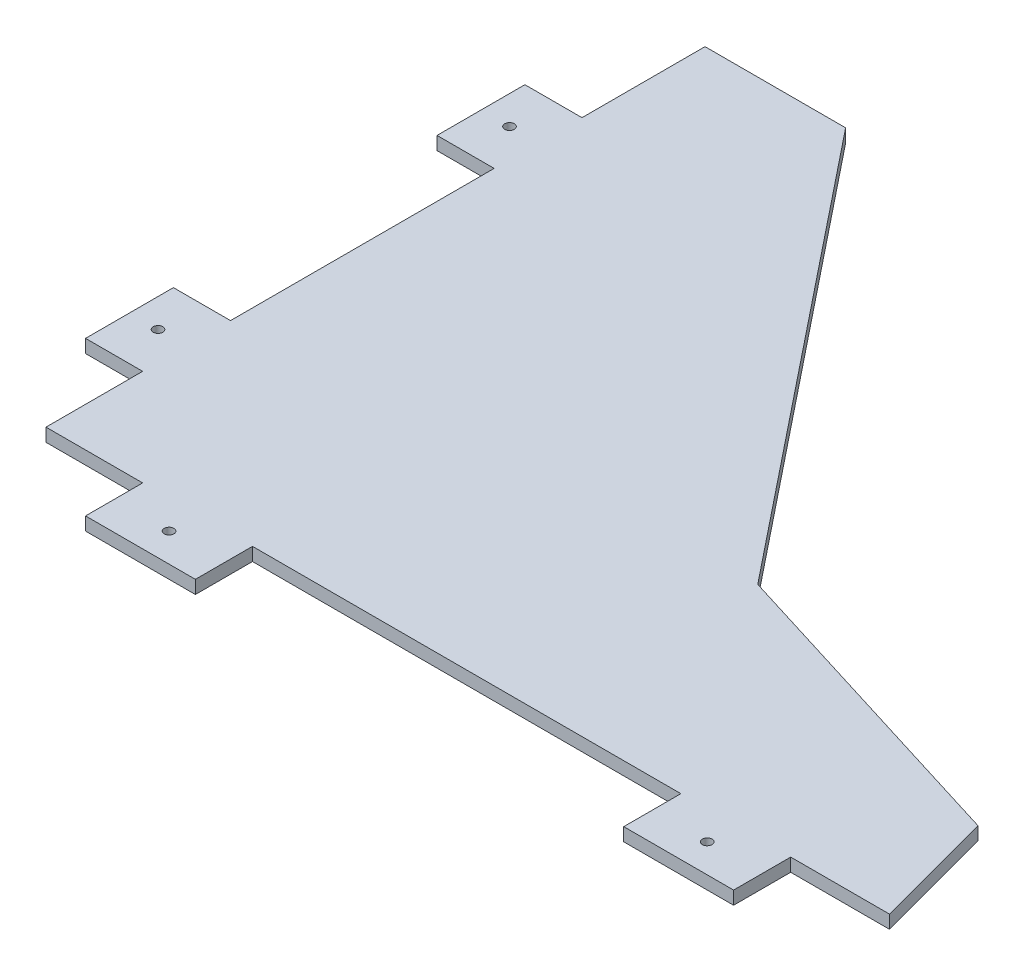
from build123d import *

# Parameters (mm, degrees)
SKIZZE1_R                       = 2.2
AUFSATZ_LINEAR_AUSTRAGEN1_DEPTH = 6


with BuildPart() as part:
    # Skizze1 → Aufsatz-Linear austragen1 (new body)
    with BuildSketch(Plane(origin=(0, 0, 0), x_dir=(1, 0, 0), z_dir=(0, 1, 0))):
        Polygon((-192, 54), (-192, -66), (-218, -66), (-218, -106), (-192, -106), (-192, -150), (-148, -150), (-148, -176), (-98, -176), (-98, -150), (97, -150), (97, -176), (147, -176), (147, -150), (192, -150), (177.262794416, -95), (32, -50), (-128, 150), (-192, 150), (-192, 94), (-218, 94), (-218, 54), align=None)
        with Locations(Location((-205, 74, 0), (0, 0, 270))):
            Circle(SKIZZE1_R, mode=Mode.SUBTRACT)
        with Locations(Location((-205, -86, 0), (0, 0, 270))):
            Circle(SKIZZE1_R, mode=Mode.SUBTRACT)
        with Locations(Location((-123, -163, 0), (0, 0, 270))):
            Circle(SKIZZE1_R, mode=Mode.SUBTRACT)
        with Locations(Location((122, -163, 0), (0, 0, 270))):
            Circle(SKIZZE1_R, mode=Mode.SUBTRACT)
    extrude(amount=AUFSATZ_LINEAR_AUSTRAGEN1_DEPTH)


solid = part.part
